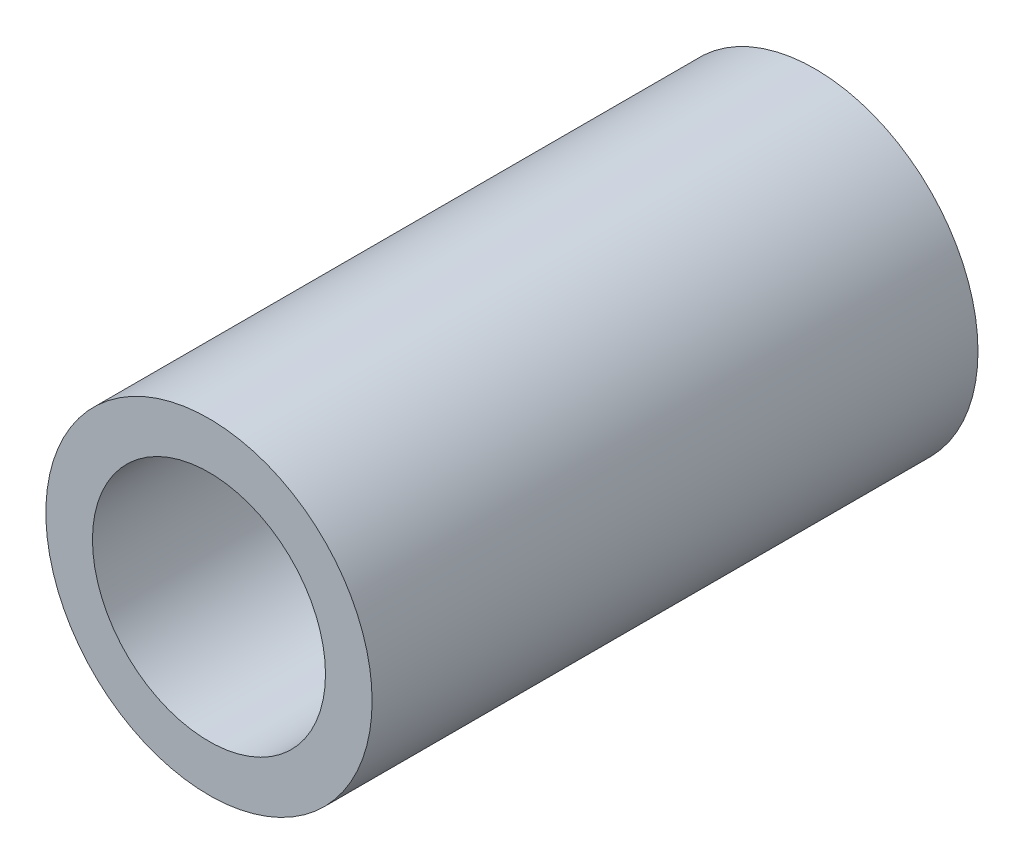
ISO-10303-21;
HEADER;
FILE_DESCRIPTION(('STEP AP214'),'2;1');
FILE_NAME('part.step','',(''),(''),'','','');
FILE_SCHEMA(('AUTOMOTIVE_DESIGN { 1 0 10303 214 1 1 1 1 }'));
ENDSEC;
DATA;
#1=APPLICATION_CONTEXT('core data for automotive mechanical design processes');
#2=APPLICATION_PROTOCOL_DEFINITION('international standard','automotive_design',2000,#1);
#3=PRODUCT_CONTEXT('',#1,'mechanical');
#4=PRODUCT('Part','Part','',(#3));
#5=PRODUCT_RELATED_PRODUCT_CATEGORY('part','',(#4));
#6=PRODUCT_DEFINITION_FORMATION('','',#4);
#7=PRODUCT_DEFINITION_CONTEXT('part definition',#1,'design');
#8=PRODUCT_DEFINITION('design','',#6,#7);
#9=PRODUCT_DEFINITION_SHAPE('','',#8);
#10=(LENGTH_UNIT() NAMED_UNIT(*) SI_UNIT(.MILLI.,.METRE.));
#11=(NAMED_UNIT(*) PLANE_ANGLE_UNIT() SI_UNIT($,.RADIAN.));
#12=(NAMED_UNIT(*) SI_UNIT($,.STERADIAN.) SOLID_ANGLE_UNIT());
#13=UNCERTAINTY_MEASURE_WITH_UNIT(LENGTH_MEASURE(1.E-05),#10,'distance_accuracy_value','');
#14=(GEOMETRIC_REPRESENTATION_CONTEXT(3) GLOBAL_UNCERTAINTY_ASSIGNED_CONTEXT((#13)) GLOBAL_UNIT_ASSIGNED_CONTEXT((#10,
#11,#12)) REPRESENTATION_CONTEXT('',''));
#15=CARTESIAN_POINT('',(0.,0.,0.));
#16=DIRECTION('',(0.,0.,1.));
#17=DIRECTION('',(1.,0.,0.));
#18=AXIS2_PLACEMENT_3D('',#15,#16,#17);
#19=CARTESIAN_POINT('',(0.,0.,26.));
#20=DIRECTION('',(0.,0.,1.));
#21=DIRECTION('',(1.,0.,0.));
#22=AXIS2_PLACEMENT_3D('',#19,#20,#21);
#23=PLANE('',#22);
#24=CARTESIAN_POINT('',(0.,0.,26.));
#25=DIRECTION('',(0.,0.,1.));
#26=DIRECTION('',(1.,0.,0.));
#27=AXIS2_PLACEMENT_3D('',#24,#25,#26);
#28=CIRCLE('',#27,7.);
#29=CARTESIAN_POINT('',(7.,0.,26.));
#30=VERTEX_POINT('',#29);
#31=EDGE_CURVE('E10',#30,#30,#28,.T.);
#32=ORIENTED_EDGE('',*,*,#31,.T.);
#33=EDGE_LOOP('',(#32));
#34=FACE_BOUND('',#33,.T.);
#35=CARTESIAN_POINT('',(0.,0.,26.));
#36=DIRECTION('',(0.,0.,1.));
#37=DIRECTION('',(1.,0.,0.));
#38=AXIS2_PLACEMENT_3D('',#35,#36,#37);
#39=CIRCLE('',#38,5.);
#40=CARTESIAN_POINT('',(5.,0.,26.));
#41=VERTEX_POINT('',#40);
#42=EDGE_CURVE('E39',#41,#41,#39,.T.);
#43=ORIENTED_EDGE('',*,*,#42,.F.);
#44=EDGE_LOOP('',(#43));
#45=FACE_BOUND('',#44,.T.);
#46=ADVANCED_FACE('F28',(#34,#45),#23,.T.);
#47=CARTESIAN_POINT('',(0.,0.,0.));
#48=DIRECTION('',(0.,0.,1.));
#49=DIRECTION('',(1.,0.,0.));
#50=AXIS2_PLACEMENT_3D('',#47,#48,#49);
#51=PLANE('',#50);
#52=CARTESIAN_POINT('',(0.,0.,0.));
#53=DIRECTION('',(0.,0.,1.));
#54=DIRECTION('',(1.,0.,0.));
#55=AXIS2_PLACEMENT_3D('',#52,#53,#54);
#56=CIRCLE('',#55,7.);
#57=CARTESIAN_POINT('',(7.,0.,0.));
#58=VERTEX_POINT('',#57);
#59=EDGE_CURVE('E35',#58,#58,#56,.T.);
#60=ORIENTED_EDGE('',*,*,#59,.F.);
#61=EDGE_LOOP('',(#60));
#62=FACE_BOUND('',#61,.T.);
#63=CARTESIAN_POINT('',(0.,0.,0.));
#64=DIRECTION('',(0.,0.,1.));
#65=DIRECTION('',(1.,0.,0.));
#66=AXIS2_PLACEMENT_3D('',#63,#64,#65);
#67=CIRCLE('',#66,5.);
#68=CARTESIAN_POINT('',(5.,0.,0.));
#69=VERTEX_POINT('',#68);
#70=EDGE_CURVE('E43',#69,#69,#67,.T.);
#71=ORIENTED_EDGE('',*,*,#70,.T.);
#72=EDGE_LOOP('',(#71));
#73=FACE_BOUND('',#72,.T.);
#74=ADVANCED_FACE('F49',(#62,#73),#51,.F.);
#75=CARTESIAN_POINT('',(0.,0.,26.));
#76=DIRECTION('',(0.,0.,-1.));
#77=DIRECTION('',(-1.,0.,0.));
#78=AXIS2_PLACEMENT_3D('',#75,#76,#77);
#79=CYLINDRICAL_SURFACE('',#78,7.);
#80=ORIENTED_EDGE('',*,*,#31,.F.);
#81=EDGE_LOOP('',(#80));
#82=FACE_BOUND('',#81,.T.);
#83=ORIENTED_EDGE('',*,*,#59,.T.);
#84=EDGE_LOOP('',(#83));
#85=FACE_BOUND('',#84,.T.);
#86=ADVANCED_FACE('F30',(#82,#85),#79,.T.);
#87=CARTESIAN_POINT('',(0.,0.,26.));
#88=DIRECTION('',(0.,0.,-1.));
#89=DIRECTION('',(-1.,0.,0.));
#90=AXIS2_PLACEMENT_3D('',#87,#88,#89);
#91=CYLINDRICAL_SURFACE('',#90,5.);
#92=ORIENTED_EDGE('',*,*,#42,.T.);
#93=EDGE_LOOP('',(#92));
#94=FACE_BOUND('',#93,.T.);
#95=ORIENTED_EDGE('',*,*,#70,.F.);
#96=EDGE_LOOP('',(#95));
#97=FACE_BOUND('',#96,.T.);
#98=ADVANCED_FACE('F51',(#94,#97),#91,.F.);
#99=CLOSED_SHELL('',(#46,#74,#86,#98));
#100=MANIFOLD_SOLID_BREP('B2',#99);
#101=ADVANCED_BREP_SHAPE_REPRESENTATION('',(#18,#100),#14);
#102=SHAPE_DEFINITION_REPRESENTATION(#9,#101);
ENDSEC;
END-ISO-10303-21;
